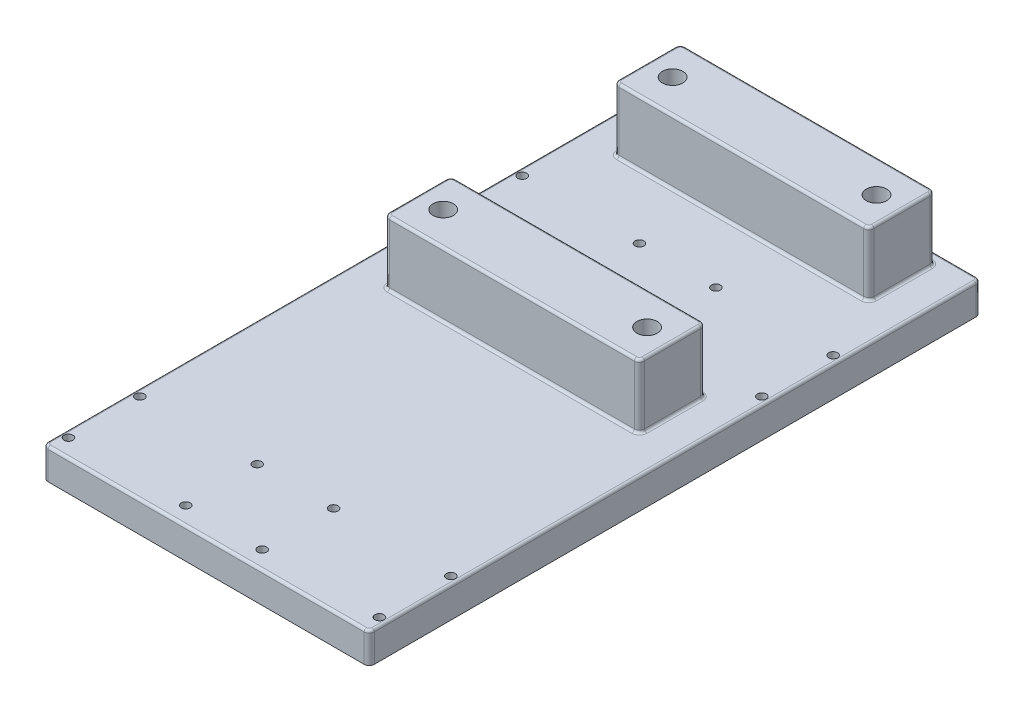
from build123d import *

# Parameters (mm, degrees)
SKETCH1_W           = 203.2
SKETCH1_H           = 381
BASE_EXTRUDE_DEPTH  = 19.05
SKETCH2_W           = 158.75
SKETCH2_H           = 41.275
BOSS_EXTRUDE1_DEPTH = 39.6875
SKETCH4_R           = 6.35
CUT_EXTRUDE1_DEPTH  = 38.1
LPATTERN1_COUNT     = 2
LPATTERN1_PITCH     = 142.875
SKETCH5_R           = 2.778125
CUT_EXTRUDE2_DEPTH  = 399.664839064
FILLET1_R           = 3.175
FILLET2_R           = 1.5875


with BuildPart() as part:
    # Sketch1 → Base-Extrude (new body)
    with BuildSketch(Plane(origin=(0, 0, 0), x_dir=(1, 0, 0), z_dir=(0, 1, 0))):
        with Locations((0, -190.5)):
            Rectangle(SKETCH1_W, SKETCH1_H)
    extrude(amount=BASE_EXTRUDE_DEPTH)

    # Sketch2 → Boss-Extrude1 (add)
    with BuildSketch(Plane(origin=(0, 19.05, 0), x_dir=(-1, 0, 0), z_dir=(0, 1, 0))):
        with Locations((0, 26.9875)):
            Rectangle(SKETCH2_W, SKETCH2_H)
    boss_extrude1 = extrude(amount=BOSS_EXTRUDE1_DEPTH)

    # Sketch4 → Cut-Extrude1 (cut)
    with BuildSketch(Plane(origin=(0, 58.7375, 0), x_dir=(-1, 0, 0), z_dir=(0, 1, 0))):
        with Locations(Location((-63.5, 26.9875, 0), (0, 0, 90))):
            Circle(SKETCH4_R)
        with Locations(Location((63.5, 26.9875, 0), (0, 0, 90))):
            Circle(SKETCH4_R)
    cut_extrude1 = extrude(amount=-CUT_EXTRUDE1_DEPTH, mode=Mode.SUBTRACT)

    # LPattern1: Boss-Extrude1, Cut-Extrude1 ×2
    with Locations(*[(0, 0, i * LPATTERN1_PITCH) for i in range(1, LPATTERN1_COUNT)]):
        add(boss_extrude1)
        add(cut_extrude1, mode=Mode.SUBTRACT)

    # Sketch5 → Cut-Extrude2 (cut, through all)
    with BuildSketch(Plane.XZ):
        with Locations(Location((96.8375, 87.3125, 0), (0, 0, 270))):
            Circle(SKETCH5_R)
        with Locations(Location((96.8375, 131.7625, 0), (0, 0, 270))):
            Circle(SKETCH5_R)
        with Locations(Location((96.8375, 369.8875, 0), (0, 0, 270))):
            Circle(SKETCH5_R)
        with Locations(Location((96.8375, 325.4375, 0), (0, 0, 270))):
            Circle(SKETCH5_R)
        with Locations(Location((23.8125, 87.3125, 0), (0, 0, 270))):
            Circle(SKETCH5_R)
        with Locations(Location((23.8125, 131.7625, 0), (0, 0, 270))):
            Circle(SKETCH5_R)
        with Locations(Location((-96.8375, 325.4375, 0), (0, 0, 270))):
            Circle(SKETCH5_R)
        with Locations(Location((-96.8375, 369.8875, 0), (0, 0, 270))):
            Circle(SKETCH5_R)
        with Locations(Location((-23.8125, 369.8875, 0), (0, 0, 270))):
            Circle(SKETCH5_R)
        with Locations(Location((-23.8125, 325.4375, 0), (0, 0, 270))):
            Circle(SKETCH5_R)
        with Locations(Location((-96.8375, 87.3125, 0), (0, 0, 270))):
            Circle(SKETCH5_R)
        with Locations(Location((-96.8375, 131.7625, 0), (0, 0, 270))):
            Circle(SKETCH5_R)
        with Locations(Location((-23.8125, 131.7625, 0), (0, 0, 270))):
            Circle(SKETCH5_R)
        with Locations(Location((-23.8125, 87.3125, 0), (0, 0, 270))):
            Circle(SKETCH5_R)
        with Locations(Location((23.8125, 369.8875, 0), (0, 0, 270))):
            Circle(SKETCH5_R)
        with Locations(Location((23.8125, 325.4375, 0), (0, 0, 270))):
            Circle(SKETCH5_R)
    extrude(amount=-CUT_EXTRUDE2_DEPTH, mode=Mode.SUBTRACT)

    # Fillet1
    fillet1_edges = [part.edges().sort_by_distance(p)[0] for p in [
        (-79.375, 38.89375, 6.35),
        (-79.375, 38.89375, 47.625),
        (79.375, 38.89375, 47.625),
        (79.375, 38.89375, 6.35),
        (-79.375, 38.89375, 149.225),
        (-79.375, 38.89375, 190.5),
        (79.375, 38.89375, 190.5),
        (79.375, 38.89375, 149.225),
        (101.6, 9.525, 0),
        (-101.6, 9.525, 0),
        (-101.6, 9.525, 381),
        (101.6, 9.525, 381),
    ]]
    fillet(fillet1_edges, radius=FILLET1_R)

    # Fillet2
    fillet2_edges = [part.edges().sort_by_distance(p)[0] for p in [
        (0, 19.05, 381),
        (-101.6, 19.05, 190.5),
        (0, 19.05, 47.625),
        (-79.375, 19.05, 26.9875),
        (0, 19.05, 6.35),
        (79.375, 19.05, 26.9875),
        (101.6, 19.05, 190.5),
        (0, 19.05, 0),
        (0, 19.05, 190.5),
        (-79.375, 19.05, 169.8625),
        (0, 19.05, 149.225),
        (79.375, 19.05, 169.8625),
        (-100.67006403, 19.05, 0.92993597),
        (100.67006403, 19.05, 0.92993597),
        (100.67006403, 19.05, 380.07006403),
        (-100.67006403, 19.05, 380.07006403),
        (-79.375, 58.7375, 26.9875),
        (0, 58.7375, 6.35),
        (0, 58.7375, 47.625),
        (79.375, 58.7375, 26.9875),
        (-78.44506403, 58.7375, 46.69506403),
        (78.44506403, 58.7375, 46.69506403),
        (78.44506403, 58.7375, 7.27993597),
        (-78.44506403, 58.7375, 7.27993597),
        (0, 58.7375, 190.5),
        (-79.375, 58.7375, 169.8625),
        (79.375, 58.7375, 169.8625),
        (0, 58.7375, 149.225),
        (78.44506403, 58.7375, 189.57006403),
        (78.44506403, 58.7375, 150.15493597),
        (-78.44506403, 58.7375, 150.15493597),
        (-78.44506403, 58.7375, 189.57006403),
        (-78.44506403, 19.05, 7.27993597),
        (78.44506403, 19.05, 7.27993597),
        (78.44506403, 19.05, 46.69506403),
        (-78.44506403, 19.05, 46.69506403),
        (-78.44506403, 19.05, 189.57006403),
        (-78.44506403, 19.05, 150.15493597),
        (78.44506403, 19.05, 150.15493597),
        (78.44506403, 19.05, 189.57006403),
    ]]
    fillet(fillet2_edges, radius=FILLET2_R)


solid = part.part
